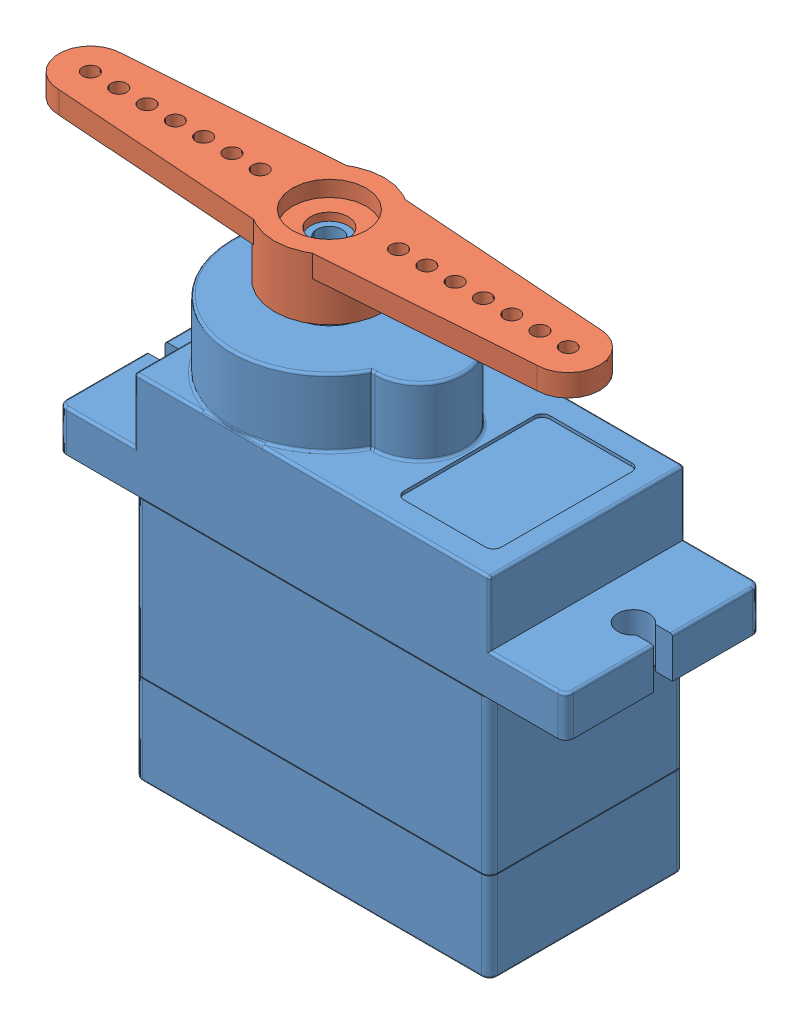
SolidWorks assembly microservoAssembly.SLDASM, configuration Default (file format 14000). Lengths in mm.
Overall size (38.45 31.3 12.5).
2 component instances, 2 part files, 2 mates.
Components (placement in the parent):
- microservoSG90-1: microservoSG90.SLDPRT [Default] at (7.8094 3.3655 26.0766) size (32.3 29.8 12.5)
- microservoArm-1: microservoArm.SLDPRT [A2] at (2.7094 34.6655 26.0766) x (-1 0 0.000751) z (0.000751 0 1) size (34.4 3.9 7)
Mates (geometry in assembly coordinates):
- Concentric1: concentric anti-aligned: circle of microservoSG90-1; circle of microservoArm-1
- Coincident2: coincident anti-aligned: plane of microservoSG90-1 through (2.7094 33.1655 26.0766) normal (0 1 0); plane of microservoArm-1 through (2.7094 33.1655 26.0766) normal (0 -1 0)
